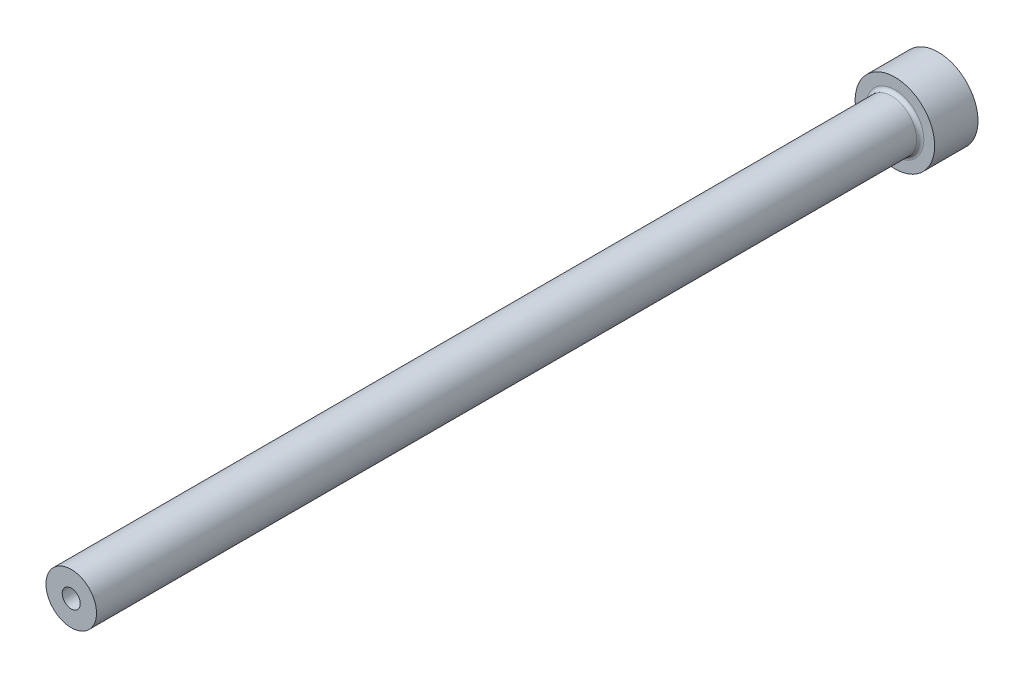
ISO-10303-21;
HEADER;
FILE_DESCRIPTION(('STEP AP214'),'2;1');
FILE_NAME('part.step','',(''),(''),'','','');
FILE_SCHEMA(('AUTOMOTIVE_DESIGN { 1 0 10303 214 1 1 1 1 }'));
ENDSEC;
DATA;
#1=APPLICATION_CONTEXT('core data for automotive mechanical design processes');
#2=APPLICATION_PROTOCOL_DEFINITION('international standard','automotive_design',2000,#1);
#3=PRODUCT_CONTEXT('',#1,'mechanical');
#4=PRODUCT('Part','Part','',(#3));
#5=PRODUCT_RELATED_PRODUCT_CATEGORY('part','',(#4));
#6=PRODUCT_DEFINITION_FORMATION('','',#4);
#7=PRODUCT_DEFINITION_CONTEXT('part definition',#1,'design');
#8=PRODUCT_DEFINITION('design','',#6,#7);
#9=PRODUCT_DEFINITION_SHAPE('','',#8);
#10=(LENGTH_UNIT() NAMED_UNIT(*) SI_UNIT(.MILLI.,.METRE.));
#11=(NAMED_UNIT(*) PLANE_ANGLE_UNIT() SI_UNIT($,.RADIAN.));
#12=(NAMED_UNIT(*) SI_UNIT($,.STERADIAN.) SOLID_ANGLE_UNIT());
#13=UNCERTAINTY_MEASURE_WITH_UNIT(LENGTH_MEASURE(1.E-05),#10,'distance_accuracy_value','');
#14=(GEOMETRIC_REPRESENTATION_CONTEXT(3) GLOBAL_UNCERTAINTY_ASSIGNED_CONTEXT((#13)) GLOBAL_UNIT_ASSIGNED_CONTEXT((#10,
#11,#12)) REPRESENTATION_CONTEXT('',''));
#15=CARTESIAN_POINT('',(0.,0.,0.));
#16=DIRECTION('',(0.,0.,1.));
#17=DIRECTION('',(1.,0.,0.));
#18=AXIS2_PLACEMENT_3D('',#15,#16,#17);
#19=CARTESIAN_POINT('',(0.,0.,120.));
#20=DIRECTION('',(0.,0.,-1.));
#21=DIRECTION('',(-1.,0.,0.));
#22=AXIS2_PLACEMENT_3D('',#19,#20,#21);
#23=PLANE('',#22);
#24=CARTESIAN_POINT('',(0.,0.,120.));
#25=DIRECTION('',(0.,0.,1.));
#26=DIRECTION('',(1.,0.,0.));
#27=AXIS2_PLACEMENT_3D('',#24,#25,#26);
#28=CIRCLE('',#27,1.24999999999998);
#29=CARTESIAN_POINT('',(1.24999999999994,0.,120.));
#30=VERTEX_POINT('',#29);
#31=EDGE_CURVE('E63',#30,#30,#28,.T.);
#32=ORIENTED_EDGE('',*,*,#31,.F.);
#33=EDGE_LOOP('',(#32));
#34=FACE_BOUND('',#33,.T.);
#35=CARTESIAN_POINT('',(0.,0.,120.));
#36=DIRECTION('',(0.,0.,1.));
#37=DIRECTION('',(1.,0.,0.));
#38=AXIS2_PLACEMENT_3D('',#35,#36,#37);
#39=CIRCLE('',#38,3.49999999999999);
#40=CARTESIAN_POINT('',(3.49999999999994,0.,120.));
#41=VERTEX_POINT('',#40);
#42=EDGE_CURVE('E54',#41,#41,#39,.T.);
#43=ORIENTED_EDGE('',*,*,#42,.T.);
#44=EDGE_LOOP('',(#43));
#45=FACE_BOUND('',#44,.T.);
#46=ADVANCED_FACE('F34',(#34,#45),#23,.F.);
#47=CARTESIAN_POINT('',(0.,0.,120.));
#48=DIRECTION('',(0.,0.,1.));
#49=DIRECTION('',(1.,0.,0.));
#50=AXIS2_PLACEMENT_3D('',#47,#48,#49);
#51=CYLINDRICAL_SURFACE('',#50,3.49999999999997);
#52=CARTESIAN_POINT('',(0.,0.,6.49999999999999));
#53=DIRECTION('',(0.,0.,1.));
#54=DIRECTION('',(1.,0.,0.));
#55=AXIS2_PLACEMENT_3D('',#52,#53,#54);
#56=CIRCLE('',#55,3.49999999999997);
#57=CARTESIAN_POINT('',(3.49999999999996,0.,6.49999999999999));
#58=VERTEX_POINT('',#57);
#59=EDGE_CURVE('E49',#58,#58,#56,.T.);
#60=ORIENTED_EDGE('',*,*,#59,.T.);
#61=EDGE_LOOP('',(#60));
#62=FACE_BOUND('',#61,.T.);
#63=ORIENTED_EDGE('',*,*,#42,.F.);
#64=EDGE_LOOP('',(#63));
#65=FACE_BOUND('',#64,.T.);
#66=ADVANCED_FACE('F92',(#62,#65),#51,.T.);
#67=CARTESIAN_POINT('',(0.,0.,6.));
#68=DIRECTION('',(0.,0.,1.));
#69=DIRECTION('',(1.,0.,0.));
#70=AXIS2_PLACEMENT_3D('',#67,#68,#69);
#71=PLANE('',#70);
#72=CARTESIAN_POINT('',(0.,0.,6.));
#73=DIRECTION('',(0.,0.,1.));
#74=DIRECTION('',(1.,0.,0.));
#75=AXIS2_PLACEMENT_3D('',#72,#73,#74);
#76=CIRCLE('',#75,3.99999999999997);
#77=CARTESIAN_POINT('',(3.99999999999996,0.,6.));
#78=VERTEX_POINT('',#77);
#79=EDGE_CURVE('E45',#78,#78,#76,.F.);
#80=ORIENTED_EDGE('',*,*,#79,.T.);
#81=EDGE_LOOP('',(#80));
#82=FACE_BOUND('',#81,.T.);
#83=CARTESIAN_POINT('',(0.,0.,6.00000000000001));
#84=DIRECTION('',(0.,0.,1.));
#85=DIRECTION('',(1.,0.,0.));
#86=AXIS2_PLACEMENT_3D('',#83,#84,#85);
#87=CIRCLE('',#86,5.49999999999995);
#88=CARTESIAN_POINT('',(5.49999999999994,0.,6.00000000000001));
#89=VERTEX_POINT('',#88);
#90=EDGE_CURVE('E57',#89,#89,#87,.T.);
#91=ORIENTED_EDGE('',*,*,#90,.T.);
#92=EDGE_LOOP('',(#91));
#93=FACE_BOUND('',#92,.T.);
#94=ADVANCED_FACE('F98',(#82,#93),#71,.T.);
#95=CARTESIAN_POINT('',(0.,0.,120.));
#96=DIRECTION('',(0.,0.,1.));
#97=DIRECTION('',(1.,0.,0.));
#98=AXIS2_PLACEMENT_3D('',#95,#96,#97);
#99=CYLINDRICAL_SURFACE('',#98,5.49999999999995);
#100=ORIENTED_EDGE('',*,*,#90,.F.);
#101=EDGE_LOOP('',(#100));
#102=FACE_BOUND('',#101,.T.);
#103=CARTESIAN_POINT('',(0.,0.,0.));
#104=DIRECTION('',(0.,0.,1.));
#105=DIRECTION('',(1.,0.,0.));
#106=AXIS2_PLACEMENT_3D('',#103,#104,#105);
#107=CIRCLE('',#106,5.49999999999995);
#108=CARTESIAN_POINT('',(5.49999999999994,0.,0.));
#109=VERTEX_POINT('',#108);
#110=EDGE_CURVE('E60',#109,#109,#107,.T.);
#111=ORIENTED_EDGE('',*,*,#110,.T.);
#112=EDGE_LOOP('',(#111));
#113=FACE_BOUND('',#112,.T.);
#114=ADVANCED_FACE('F89',(#102,#113),#99,.T.);
#115=CARTESIAN_POINT('',(0.,0.,0.));
#116=DIRECTION('',(0.,0.,1.));
#117=DIRECTION('',(1.,0.,0.));
#118=AXIS2_PLACEMENT_3D('',#115,#116,#117);
#119=PLANE('',#118);
#120=CARTESIAN_POINT('',(0.,0.,0.));
#121=DIRECTION('',(0.,0.,1.));
#122=DIRECTION('',(1.,0.,0.));
#123=AXIS2_PLACEMENT_3D('',#120,#121,#122);
#124=CIRCLE('',#123,1.99999999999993);
#125=CARTESIAN_POINT('',(1.9999999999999,0.,0.));
#126=VERTEX_POINT('',#125);
#127=EDGE_CURVE('E41',#126,#126,#124,.T.);
#128=ORIENTED_EDGE('',*,*,#127,.T.);
#129=EDGE_LOOP('',(#128));
#130=FACE_BOUND('',#129,.T.);
#131=ORIENTED_EDGE('',*,*,#110,.F.);
#132=EDGE_LOOP('',(#131));
#133=FACE_BOUND('',#132,.T.);
#134=ADVANCED_FACE('F83',(#130,#133),#119,.F.);
#135=CARTESIAN_POINT('',(0.,0.,120.));
#136=DIRECTION('',(0.,0.,1.));
#137=DIRECTION('',(1.,0.,0.));
#138=AXIS2_PLACEMENT_3D('',#135,#136,#137);
#139=CYLINDRICAL_SURFACE('',#138,1.24999999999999);
#140=ORIENTED_EDGE('',*,*,#31,.T.);
#141=EDGE_LOOP('',(#140));
#142=FACE_BOUND('',#141,.T.);
#143=CARTESIAN_POINT('',(0.,0.,70.));
#144=DIRECTION('',(0.,0.,1.));
#145=DIRECTION('',(1.,0.,0.));
#146=AXIS2_PLACEMENT_3D('',#143,#144,#145);
#147=CIRCLE('',#146,1.24999999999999);
#148=CARTESIAN_POINT('',(1.24999999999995,0.,70.));
#149=VERTEX_POINT('',#148);
#150=EDGE_CURVE('E66',#149,#149,#147,.T.);
#151=ORIENTED_EDGE('',*,*,#150,.F.);
#152=EDGE_LOOP('',(#151));
#153=FACE_BOUND('',#152,.T.);
#154=ADVANCED_FACE('F78',(#142,#153),#139,.F.);
#155=CARTESIAN_POINT('',(0.,0.,70.));
#156=DIRECTION('',(0.,0.,-1.));
#157=DIRECTION('',(-1.,0.,0.));
#158=AXIS2_PLACEMENT_3D('',#155,#156,#157);
#159=CONICAL_SURFACE('',#158,1.24999999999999,0.523598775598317);
#160=CARTESIAN_POINT('',(0.,0.,69.5669872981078));
#161=DIRECTION('',(0.,0.,1.));
#162=DIRECTION('',(1.,0.,0.));
#163=AXIS2_PLACEMENT_3D('',#160,#161,#162);
#164=CIRCLE('',#163,1.49999999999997);
#165=CARTESIAN_POINT('',(1.49999999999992,0.,69.5669872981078));
#166=VERTEX_POINT('',#165);
#167=EDGE_CURVE('E69',#166,#166,#164,.T.);
#168=ORIENTED_EDGE('',*,*,#167,.F.);
#169=EDGE_LOOP('',(#168));
#170=FACE_BOUND('',#169,.T.);
#171=ORIENTED_EDGE('',*,*,#150,.T.);
#172=EDGE_LOOP('',(#171));
#173=FACE_BOUND('',#172,.T.);
#174=ADVANCED_FACE('F75',(#170,#173),#159,.F.);
#175=CARTESIAN_POINT('',(0.,0.,120.));
#176=DIRECTION('',(0.,0.,1.));
#177=DIRECTION('',(1.,0.,0.));
#178=AXIS2_PLACEMENT_3D('',#175,#176,#177);
#179=CYLINDRICAL_SURFACE('',#178,1.49999999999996);
#180=CARTESIAN_POINT('',(0.,0.,0.499999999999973));
#181=DIRECTION('',(0.,0.,1.));
#182=DIRECTION('',(1.,0.,0.));
#183=AXIS2_PLACEMENT_3D('',#180,#181,#182);
#184=CIRCLE('',#183,1.49999999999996);
#185=CARTESIAN_POINT('',(1.49999999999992,0.,0.499999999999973));
#186=VERTEX_POINT('',#185);
#187=EDGE_CURVE('E10',#186,#186,#184,.F.);
#188=ORIENTED_EDGE('',*,*,#187,.T.);
#189=EDGE_LOOP('',(#188));
#190=FACE_BOUND('',#189,.T.);
#191=ORIENTED_EDGE('',*,*,#167,.T.);
#192=EDGE_LOOP('',(#191));
#193=FACE_BOUND('',#192,.T.);
#194=ADVANCED_FACE('F73',(#190,#193),#179,.F.);
#195=CARTESIAN_POINT('',(0.,0.,6.49999999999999));
#196=DIRECTION('',(0.,0.,1.));
#197=DIRECTION('',(1.,0.,0.));
#198=AXIS2_PLACEMENT_3D('',#195,#196,#197);
#199=TOROIDAL_SURFACE('',#198,3.99999999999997,0.5);
#200=ORIENTED_EDGE('',*,*,#79,.F.);
#201=EDGE_LOOP('',(#200));
#202=FACE_BOUND('',#201,.T.);
#203=ORIENTED_EDGE('',*,*,#59,.F.);
#204=EDGE_LOOP('',(#203));
#205=FACE_BOUND('',#204,.T.);
#206=ADVANCED_FACE('F104',(#202,#205),#199,.F.);
#207=CARTESIAN_POINT('',(0.,0.,0.));
#208=DIRECTION('',(0.,0.,-1.));
#209=DIRECTION('',(-1.,0.,0.));
#210=AXIS2_PLACEMENT_3D('',#207,#208,#209);
#211=CONICAL_SURFACE('',#210,1.99999999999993,0.785398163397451);
#212=ORIENTED_EDGE('',*,*,#187,.F.);
#213=EDGE_LOOP('',(#212));
#214=FACE_BOUND('',#213,.T.);
#215=ORIENTED_EDGE('',*,*,#127,.F.);
#216=EDGE_LOOP('',(#215));
#217=FACE_BOUND('',#216,.T.);
#218=ADVANCED_FACE('F36',(#214,#217),#211,.F.);
#219=CLOSED_SHELL('',(#46,#66,#94,#114,#134,#154,#174,#194,#206,#218));
#220=MANIFOLD_SOLID_BREP('B2',#219);
#221=ADVANCED_BREP_SHAPE_REPRESENTATION('',(#18,#220),#14);
#222=SHAPE_DEFINITION_REPRESENTATION(#9,#221);
ENDSEC;
END-ISO-10303-21;
